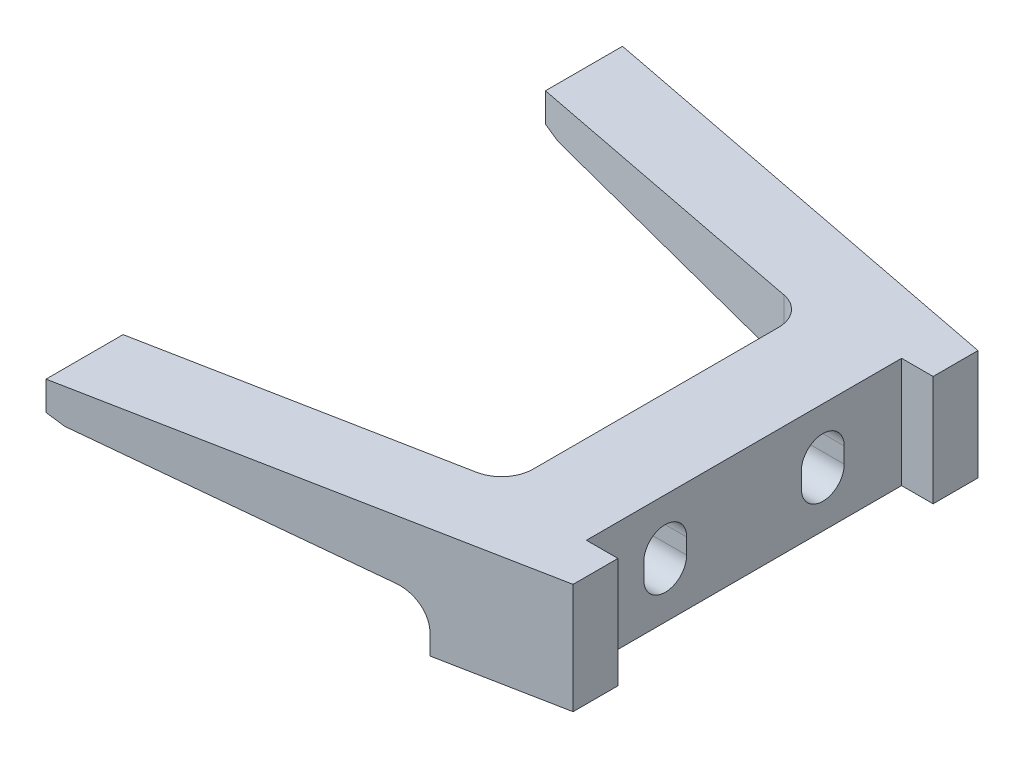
from build123d import *
from OCP.BRepFilletAPI import BRepFilletAPI_MakeChamfer

# Parameters (mm, degrees)
EXTRUDE1_DEPTH       = 25.4
CUT_EXTRUDE1_DEPTH   = 45.081873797
SKETCH4_W            = 12.7
SKETCH4_H            = 9.709193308
CUT_EXTRUDE2_DEPTH   = 2.54
EXTRUDE2_DEPTH       = 8.89
FILLET3_R            = 2.54
FILLET3_OF_MIRROR3_R = 2.54
CHAMFER1_SIZE        = 1.27
CHAMFER1_SIZE2       = 0.349795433
FILLET1_R            = 2.54
CUT_EXTRUDE4_DEPTH   = 42.3388073


with BuildPart() as part:
    # Sketch1 → Extrude1 (new body)
    with BuildSketch(Plane.XY):
        Polygon((0, -5.7912), (-35.56, -2.680103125), (-35.56, 0), (0, 0), align=None)
    extrude1 = extrude(amount=EXTRUDE1_DEPTH)

    # Sketch3 → Cut-Extrude1 (cut, through all)
    with BuildSketch(Plane(origin=(0, 0, 0), x_dir=(1, 0, 0), z_dir=(0, 1, 0))):
        Polygon((0, -16.31593318), (-46.733472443, -25.4), (0, -25.4), align=None)
        Polygon((-35.56, -17.018), (-9.652, -11.981994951), (-9.652, 0), (-35.56, 0), align=None)
    cut_extrude1 = extrude(amount=-CUT_EXTRUDE1_DEPTH, mode=Mode.SUBTRACT)

    # Mirror1: Extrude1, Cut-Extrude1 across plane
    add(extrude1.mirror(Plane.XY))
    add(cut_extrude1.mirror(Plane.XY), mode=Mode.SUBTRACT)

    # Sketch4 → Cut-Extrude2 (cut)
    with BuildSketch(Plane(origin=(0, 0, 0), x_dir=(0, 0, -1), z_dir=(1, 0, 0))):
        with Locations((6.35, -4.854596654)):
            Rectangle(SKETCH4_W, SKETCH4_H)
    cut_extrude2 = extrude(amount=-CUT_EXTRUDE2_DEPTH, mode=Mode.SUBTRACT)

    # Mirror2: Cut-Extrude2 across plane
    add(cut_extrude2.mirror(Plane.XY), mode=Mode.SUBTRACT)

    # Sketch7 → Extrude2 (add)
    with BuildSketch(Plane(origin=(0, 0, 0), x_dir=(-1, 0, 0), z_dir=(0, 1, 0))):
        Polygon((9.652, 18.192091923), (0, 16.31593318), (0, 12.7), (2.54, 12.7), (2.54, 0), (9.652, 0), align=None)
    extrude2 = extrude(amount=-EXTRUDE2_DEPTH)

    # Fillet3
    fillet3_edges = [part.edges().sort_by_distance(p)[0] for p in [
        (-9.652, -4.94675942, 15.087043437),
    ]]
    fillet(fillet3_edges, radius=FILLET3_R)

    # Mirror3: Extrude2 across plane
    add(extrude2.mirror(Plane.XY))

    # Fillet3 of Mirror3
    fillet3_of_mirror3_edges = [part.edges().sort_by_distance(p)[0] for p in [
        (-9.652, -4.94675942, -15.087043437),
    ]]
    fillet(fillet3_of_mirror3_edges, radius=FILLET3_OF_MIRROR3_R)

    # Chamfer1: one chamfer whose edges measure the first distance from different faces: ONE call of the kernel's chamfer builder (chamfer() names one face for all edges)
    chamfer1_edges_1 = [part.edges().sort_by_distance(p)[0] for p in [
        (-35.56, -2.680103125, 20.123048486),
    ]]
    chamfer1_side_1 = [part.faces().sort_by_distance(p)[0] for p in [
        (-23.765312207, -3.712004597, 17.830393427),
    ]]
    chamfer1_edges_2 = [part.edges().sort_by_distance(p)[0] for p in [
        (-35.56, -2.680103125, -20.123048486),
    ]]
    chamfer1_side_2 = [part.faces().sort_by_distance(p)[0] for p in [
        (-23.765312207, -3.712004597, -17.830393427),
    ]]
    chamfer1 = BRepFilletAPI_MakeChamfer(part.part.solid().wrapped)
    for e in chamfer1_edges_1:
        chamfer1.Add(CHAMFER1_SIZE, CHAMFER1_SIZE2, e.wrapped, chamfer1_side_1[0].wrapped)  # the first distance lies on this face
    for e in chamfer1_edges_2:
        chamfer1.Add(CHAMFER1_SIZE, CHAMFER1_SIZE2, e.wrapped, chamfer1_side_2[0].wrapped)  # the first distance lies on this face
    add(Compound.cast(chamfer1.Shape()), mode=Mode.REPLACE)

    # Fillet1
    fillet1_edges = [part.edges().sort_by_distance(p)[0] for p in [
        (-9.652, -3.637120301, 11.981994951),
        (-9.652, -3.637120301, -11.981994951),
    ]]
    fillet(fillet1_edges, radius=FILLET1_R)

    # Sketch11 → Cut-Extrude4 (cut, through all)
    with BuildSketch(Plane(origin=(-2.54, 0, 0), x_dir=(0, 0, -1), z_dir=(1, 0, 0))):
        with BuildLine():
            Line((-8.0772, -5.08), (-8.0772, -3.81))
            ThreePointArc((-8.0772, -3.81), (-6.35, -2.0828), (-4.6228, -3.81))
            Line((-4.6228, -3.81), (-4.6228, -5.08))
            ThreePointArc((-4.6228, -5.08), (-6.35, -6.8072), (-8.0772, -5.08))
        make_face()
    cut_extrude4 = extrude(amount=-CUT_EXTRUDE4_DEPTH, mode=Mode.SUBTRACT)

    # Mirror4: Cut-Extrude4 across plane
    add(cut_extrude4.mirror(Plane.XY), mode=Mode.SUBTRACT)


solid = part.part
